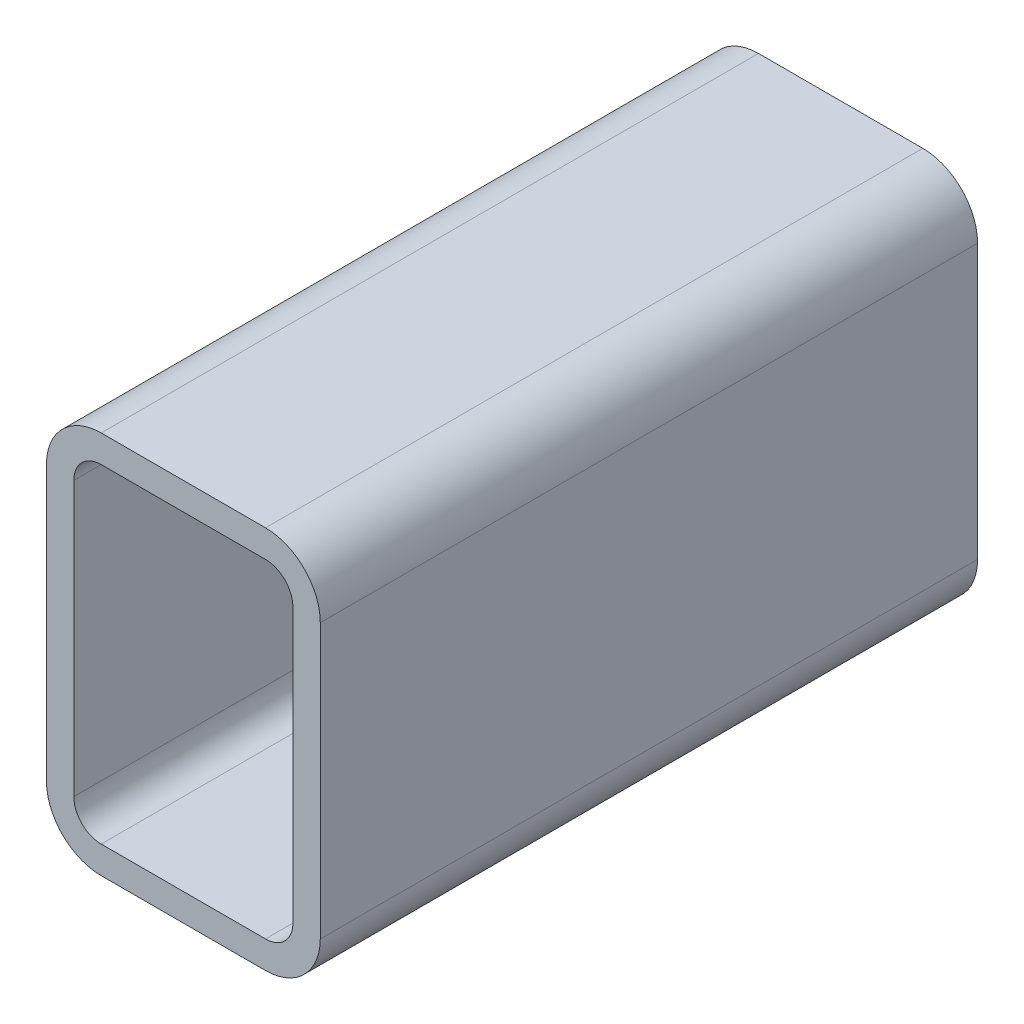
ISO-10303-21;
HEADER;
FILE_DESCRIPTION(('STEP AP214'),'2;1');
FILE_NAME('part.step','',(''),(''),'','','');
FILE_SCHEMA(('AUTOMOTIVE_DESIGN { 1 0 10303 214 1 1 1 1 }'));
ENDSEC;
DATA;
#1=APPLICATION_CONTEXT('core data for automotive mechanical design processes');
#2=APPLICATION_PROTOCOL_DEFINITION('international standard','automotive_design',2000,#1);
#3=PRODUCT_CONTEXT('',#1,'mechanical');
#4=PRODUCT('Part','Part','',(#3));
#5=PRODUCT_RELATED_PRODUCT_CATEGORY('part','',(#4));
#6=PRODUCT_DEFINITION_FORMATION('','',#4);
#7=PRODUCT_DEFINITION_CONTEXT('part definition',#1,'design');
#8=PRODUCT_DEFINITION('design','',#6,#7);
#9=PRODUCT_DEFINITION_SHAPE('','',#8);
#10=(LENGTH_UNIT() NAMED_UNIT(*) SI_UNIT(.MILLI.,.METRE.));
#11=(NAMED_UNIT(*) PLANE_ANGLE_UNIT() SI_UNIT($,.RADIAN.));
#12=(NAMED_UNIT(*) SI_UNIT($,.STERADIAN.) SOLID_ANGLE_UNIT());
#13=UNCERTAINTY_MEASURE_WITH_UNIT(LENGTH_MEASURE(1.E-05),#10,'distance_accuracy_value','');
#14=(GEOMETRIC_REPRESENTATION_CONTEXT(3) GLOBAL_UNCERTAINTY_ASSIGNED_CONTEXT((#13)) GLOBAL_UNIT_ASSIGNED_CONTEXT((#10,
#11,#12)) REPRESENTATION_CONTEXT('',''));
#15=CARTESIAN_POINT('',(0.,0.,0.));
#16=DIRECTION('',(0.,0.,1.));
#17=DIRECTION('',(1.,0.,0.));
#18=AXIS2_PLACEMENT_3D('',#15,#16,#17);
#19=CARTESIAN_POINT('',(26.2612396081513,154.389039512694,304.8));
#20=DIRECTION('',(0.,0.,1.));
#21=DIRECTION('',(1.,0.,0.));
#22=AXIS2_PLACEMENT_3D('',#19,#20,#21);
#23=PLANE('',#22);
#24=CARTESIAN_POINT('',(26.2612396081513,154.389039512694,304.8));
#25=DIRECTION('',(0.,0.,1.));
#26=DIRECTION('',(1.,0.,0.));
#27=AXIS2_PLACEMENT_3D('',#24,#25,#26);
#28=CIRCLE('',#27,25.4);
#29=CARTESIAN_POINT('',(26.2612396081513,179.789039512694,304.8));
#30=VERTEX_POINT('',#29);
#31=CARTESIAN_POINT('',(0.8612396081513,154.389039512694,304.8));
#32=VERTEX_POINT('',#31);
#33=EDGE_CURVE('E211',#30,#32,#28,.T.);
#34=ORIENTED_EDGE('',*,*,#33,.T.);
#35=DIRECTION('',(0.,-1.,0.));
#36=VECTOR('',#35,1.);
#37=CARTESIAN_POINT('',(0.8612396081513,27.3890395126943,304.8));
#38=LINE('',#37,#36);
#39=CARTESIAN_POINT('',(0.861239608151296,27.3890395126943,304.8));
#40=VERTEX_POINT('',#39);
#41=EDGE_CURVE('E214',#32,#40,#38,.T.);
#42=ORIENTED_EDGE('',*,*,#41,.T.);
#43=CARTESIAN_POINT('',(26.2612396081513,27.3890395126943,304.8));
#44=DIRECTION('',(0.,0.,1.));
#45=DIRECTION('',(1.,0.,0.));
#46=AXIS2_PLACEMENT_3D('',#43,#44,#45);
#47=CIRCLE('',#46,25.4);
#48=CARTESIAN_POINT('',(26.2612396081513,1.98903951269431,304.8));
#49=VERTEX_POINT('',#48);
#50=EDGE_CURVE('E217',#40,#49,#47,.T.);
#51=ORIENTED_EDGE('',*,*,#50,.T.);
#52=DIRECTION('',(1.,0.,0.));
#53=VECTOR('',#52,1.);
#54=CARTESIAN_POINT('',(102.461239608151,1.98903951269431,304.8));
#55=LINE('',#54,#53);
#56=CARTESIAN_POINT('',(102.461239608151,1.98903951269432,304.8));
#57=VERTEX_POINT('',#56);
#58=EDGE_CURVE('E219',#49,#57,#55,.T.);
#59=ORIENTED_EDGE('',*,*,#58,.T.);
#60=CARTESIAN_POINT('',(102.461239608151,27.3890395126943,304.8));
#61=DIRECTION('',(0.,0.,1.));
#62=DIRECTION('',(1.,0.,0.));
#63=AXIS2_PLACEMENT_3D('',#60,#61,#62);
#64=CIRCLE('',#63,25.4);
#65=CARTESIAN_POINT('',(127.861239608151,27.3890395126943,304.8));
#66=VERTEX_POINT('',#65);
#67=EDGE_CURVE('E221',#57,#66,#64,.T.);
#68=ORIENTED_EDGE('',*,*,#67,.T.);
#69=DIRECTION('',(0.,1.,0.));
#70=VECTOR('',#69,1.);
#71=CARTESIAN_POINT('',(127.861239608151,154.389039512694,304.8));
#72=LINE('',#71,#70);
#73=CARTESIAN_POINT('',(127.861239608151,154.389039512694,304.8));
#74=VERTEX_POINT('',#73);
#75=EDGE_CURVE('E223',#66,#74,#72,.T.);
#76=ORIENTED_EDGE('',*,*,#75,.T.);
#77=CARTESIAN_POINT('',(102.461239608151,154.389039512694,304.8));
#78=DIRECTION('',(0.,0.,1.));
#79=DIRECTION('',(1.,0.,0.));
#80=AXIS2_PLACEMENT_3D('',#77,#78,#79);
#81=CIRCLE('',#80,25.4);
#82=CARTESIAN_POINT('',(102.461239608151,179.789039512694,304.8));
#83=VERTEX_POINT('',#82);
#84=EDGE_CURVE('E225',#74,#83,#81,.T.);
#85=ORIENTED_EDGE('',*,*,#84,.T.);
#86=DIRECTION('',(-1.,0.,0.));
#87=VECTOR('',#86,1.);
#88=CARTESIAN_POINT('',(26.2612396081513,179.789039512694,304.8));
#89=LINE('',#88,#87);
#90=EDGE_CURVE('E227',#83,#30,#89,.T.);
#91=ORIENTED_EDGE('',*,*,#90,.T.);
#92=EDGE_LOOP('',(#34,#42,#51,#59,#68,#76,#85,#91));
#93=FACE_BOUND('',#92,.T.);
#94=DIRECTION('',(0.,-1.,0.));
#95=VECTOR('',#94,1.);
#96=CARTESIAN_POINT('',(13.5612396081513,27.3890395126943,304.8));
#97=LINE('',#96,#95);
#98=CARTESIAN_POINT('',(13.5612396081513,154.389039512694,304.8));
#99=VERTEX_POINT('',#98);
#100=CARTESIAN_POINT('',(13.5612396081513,27.3890395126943,304.8));
#101=VERTEX_POINT('',#100);
#102=EDGE_CURVE('E154',#99,#101,#97,.T.);
#103=ORIENTED_EDGE('',*,*,#102,.F.);
#104=CARTESIAN_POINT('',(26.2612396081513,154.389039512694,304.8));
#105=DIRECTION('',(0.,0.,1.));
#106=DIRECTION('',(1.,0.,0.));
#107=AXIS2_PLACEMENT_3D('',#104,#105,#106);
#108=CIRCLE('',#107,12.7);
#109=CARTESIAN_POINT('',(26.2612396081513,167.089039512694,304.8));
#110=VERTEX_POINT('',#109);
#111=EDGE_CURVE('E146',#110,#99,#108,.T.);
#112=ORIENTED_EDGE('',*,*,#111,.F.);
#113=DIRECTION('',(-1.,0.,0.));
#114=VECTOR('',#113,1.);
#115=CARTESIAN_POINT('',(26.2612396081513,167.089039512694,304.8));
#116=LINE('',#115,#114);
#117=CARTESIAN_POINT('',(102.461239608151,167.089039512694,304.8));
#118=VERTEX_POINT('',#117);
#119=EDGE_CURVE('E179',#118,#110,#116,.T.);
#120=ORIENTED_EDGE('',*,*,#119,.F.);
#121=CARTESIAN_POINT('',(102.461239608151,154.389039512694,304.8));
#122=DIRECTION('',(0.,0.,1.));
#123=DIRECTION('',(1.,0.,0.));
#124=AXIS2_PLACEMENT_3D('',#121,#122,#123);
#125=CIRCLE('',#124,12.7);
#126=CARTESIAN_POINT('',(115.161239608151,154.389039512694,304.8));
#127=VERTEX_POINT('',#126);
#128=EDGE_CURVE('E177',#127,#118,#125,.T.);
#129=ORIENTED_EDGE('',*,*,#128,.F.);
#130=DIRECTION('',(0.,1.,0.));
#131=VECTOR('',#130,1.);
#132=CARTESIAN_POINT('',(115.161239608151,154.389039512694,304.8));
#133=LINE('',#132,#131);
#134=CARTESIAN_POINT('',(115.161239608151,27.3890395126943,304.8));
#135=VERTEX_POINT('',#134);
#136=EDGE_CURVE('E175',#135,#127,#133,.T.);
#137=ORIENTED_EDGE('',*,*,#136,.F.);
#138=CARTESIAN_POINT('',(102.461239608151,27.3890395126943,304.8));
#139=DIRECTION('',(0.,0.,1.));
#140=DIRECTION('',(1.,0.,0.));
#141=AXIS2_PLACEMENT_3D('',#138,#139,#140);
#142=CIRCLE('',#141,12.7);
#143=CARTESIAN_POINT('',(102.461239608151,14.6890395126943,304.8));
#144=VERTEX_POINT('',#143);
#145=EDGE_CURVE('E173',#144,#135,#142,.T.);
#146=ORIENTED_EDGE('',*,*,#145,.F.);
#147=DIRECTION('',(1.,0.,0.));
#148=VECTOR('',#147,1.);
#149=CARTESIAN_POINT('',(102.461239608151,14.6890395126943,304.8));
#150=LINE('',#149,#148);
#151=CARTESIAN_POINT('',(26.2612396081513,14.6890395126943,304.8));
#152=VERTEX_POINT('',#151);
#153=EDGE_CURVE('E169',#152,#144,#150,.T.);
#154=ORIENTED_EDGE('',*,*,#153,.F.);
#155=CARTESIAN_POINT('',(26.2612396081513,27.3890395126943,304.8));
#156=DIRECTION('',(0.,0.,1.));
#157=DIRECTION('',(1.,0.,0.));
#158=AXIS2_PLACEMENT_3D('',#155,#156,#157);
#159=CIRCLE('',#158,12.7);
#160=EDGE_CURVE('E167',#101,#152,#159,.T.);
#161=ORIENTED_EDGE('',*,*,#160,.F.);
#162=EDGE_LOOP('',(#103,#112,#120,#129,#137,#146,#154,#161));
#163=FACE_BOUND('',#162,.T.);
#164=ADVANCED_FACE('F33',(#93,#163),#23,.T.);
#165=CARTESIAN_POINT('',(26.2612396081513,154.389039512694,0.));
#166=DIRECTION('',(0.,0.,1.));
#167=DIRECTION('',(1.,0.,0.));
#168=AXIS2_PLACEMENT_3D('',#165,#166,#167);
#169=PLANE('',#168);
#170=CARTESIAN_POINT('',(26.2612396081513,154.389039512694,0.));
#171=DIRECTION('',(0.,0.,1.));
#172=DIRECTION('',(1.,0.,0.));
#173=AXIS2_PLACEMENT_3D('',#170,#171,#172);
#174=CIRCLE('',#173,25.4);
#175=CARTESIAN_POINT('',(26.2612396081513,179.789039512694,0.));
#176=VERTEX_POINT('',#175);
#177=CARTESIAN_POINT('',(0.8612396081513,154.389039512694,0.));
#178=VERTEX_POINT('',#177);
#179=EDGE_CURVE('E162',#176,#178,#174,.T.);
#180=ORIENTED_EDGE('',*,*,#179,.F.);
#181=DIRECTION('',(-1.,0.,0.));
#182=VECTOR('',#181,1.);
#183=CARTESIAN_POINT('',(26.2612396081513,179.789039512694,0.));
#184=LINE('',#183,#182);
#185=CARTESIAN_POINT('',(102.461239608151,179.789039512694,0.));
#186=VERTEX_POINT('',#185);
#187=EDGE_CURVE('E215',#186,#176,#184,.T.);
#188=ORIENTED_EDGE('',*,*,#187,.F.);
#189=CARTESIAN_POINT('',(102.461239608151,154.389039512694,0.));
#190=DIRECTION('',(0.,0.,1.));
#191=DIRECTION('',(1.,0.,0.));
#192=AXIS2_PLACEMENT_3D('',#189,#190,#191);
#193=CIRCLE('',#192,25.4);
#194=CARTESIAN_POINT('',(127.861239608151,154.389039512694,0.));
#195=VERTEX_POINT('',#194);
#196=EDGE_CURVE('E242',#195,#186,#193,.T.);
#197=ORIENTED_EDGE('',*,*,#196,.F.);
#198=DIRECTION('',(0.,1.,0.));
#199=VECTOR('',#198,1.);
#200=CARTESIAN_POINT('',(127.861239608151,154.389039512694,0.));
#201=LINE('',#200,#199);
#202=CARTESIAN_POINT('',(127.861239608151,27.3890395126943,0.));
#203=VERTEX_POINT('',#202);
#204=EDGE_CURVE('E240',#203,#195,#201,.T.);
#205=ORIENTED_EDGE('',*,*,#204,.F.);
#206=CARTESIAN_POINT('',(102.461239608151,27.3890395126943,0.));
#207=DIRECTION('',(0.,0.,1.));
#208=DIRECTION('',(1.,0.,0.));
#209=AXIS2_PLACEMENT_3D('',#206,#207,#208);
#210=CIRCLE('',#209,25.4);
#211=CARTESIAN_POINT('',(102.461239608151,1.98903951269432,0.));
#212=VERTEX_POINT('',#211);
#213=EDGE_CURVE('E238',#212,#203,#210,.T.);
#214=ORIENTED_EDGE('',*,*,#213,.F.);
#215=DIRECTION('',(1.,0.,0.));
#216=VECTOR('',#215,1.);
#217=CARTESIAN_POINT('',(102.461239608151,1.98903951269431,0.));
#218=LINE('',#217,#216);
#219=CARTESIAN_POINT('',(26.2612396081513,1.98903951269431,0.));
#220=VERTEX_POINT('',#219);
#221=EDGE_CURVE('E236',#220,#212,#218,.T.);
#222=ORIENTED_EDGE('',*,*,#221,.F.);
#223=CARTESIAN_POINT('',(26.2612396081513,27.3890395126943,0.));
#224=DIRECTION('',(0.,0.,1.));
#225=DIRECTION('',(1.,0.,0.));
#226=AXIS2_PLACEMENT_3D('',#223,#224,#225);
#227=CIRCLE('',#226,25.4);
#228=CARTESIAN_POINT('',(0.861239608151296,27.3890395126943,0.));
#229=VERTEX_POINT('',#228);
#230=EDGE_CURVE('E234',#229,#220,#227,.T.);
#231=ORIENTED_EDGE('',*,*,#230,.F.);
#232=DIRECTION('',(0.,-1.,0.));
#233=VECTOR('',#232,1.);
#234=CARTESIAN_POINT('',(0.8612396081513,27.3890395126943,0.));
#235=LINE('',#234,#233);
#236=EDGE_CURVE('E232',#178,#229,#235,.T.);
#237=ORIENTED_EDGE('',*,*,#236,.F.);
#238=EDGE_LOOP('',(#180,#188,#197,#205,#214,#222,#231,#237));
#239=FACE_BOUND('',#238,.T.);
#240=CARTESIAN_POINT('',(26.2612396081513,154.389039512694,0.));
#241=DIRECTION('',(0.,0.,1.));
#242=DIRECTION('',(1.,0.,0.));
#243=AXIS2_PLACEMENT_3D('',#240,#241,#242);
#244=CIRCLE('',#243,12.7);
#245=CARTESIAN_POINT('',(26.2612396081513,167.089039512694,0.));
#246=VERTEX_POINT('',#245);
#247=CARTESIAN_POINT('',(13.5612396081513,154.389039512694,0.));
#248=VERTEX_POINT('',#247);
#249=EDGE_CURVE('E56',#246,#248,#244,.T.);
#250=ORIENTED_EDGE('',*,*,#249,.T.);
#251=DIRECTION('',(0.,-1.,0.));
#252=VECTOR('',#251,1.);
#253=CARTESIAN_POINT('',(13.5612396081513,27.3890395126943,0.));
#254=LINE('',#253,#252);
#255=CARTESIAN_POINT('',(13.5612396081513,27.3890395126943,0.));
#256=VERTEX_POINT('',#255);
#257=EDGE_CURVE('E161',#248,#256,#254,.T.);
#258=ORIENTED_EDGE('',*,*,#257,.T.);
#259=CARTESIAN_POINT('',(26.2612396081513,27.3890395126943,0.));
#260=DIRECTION('',(0.,0.,1.));
#261=DIRECTION('',(1.,0.,0.));
#262=AXIS2_PLACEMENT_3D('',#259,#260,#261);
#263=CIRCLE('',#262,12.7);
#264=CARTESIAN_POINT('',(26.2612396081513,14.6890395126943,0.));
#265=VERTEX_POINT('',#264);
#266=EDGE_CURVE('E183',#256,#265,#263,.T.);
#267=ORIENTED_EDGE('',*,*,#266,.T.);
#268=DIRECTION('',(1.,0.,0.));
#269=VECTOR('',#268,1.);
#270=CARTESIAN_POINT('',(102.461239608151,14.6890395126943,0.));
#271=LINE('',#270,#269);
#272=CARTESIAN_POINT('',(102.461239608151,14.6890395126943,0.));
#273=VERTEX_POINT('',#272);
#274=EDGE_CURVE('E186',#265,#273,#271,.T.);
#275=ORIENTED_EDGE('',*,*,#274,.T.);
#276=CARTESIAN_POINT('',(102.461239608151,27.3890395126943,0.));
#277=DIRECTION('',(0.,0.,1.));
#278=DIRECTION('',(1.,0.,0.));
#279=AXIS2_PLACEMENT_3D('',#276,#277,#278);
#280=CIRCLE('',#279,12.7);
#281=CARTESIAN_POINT('',(115.161239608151,27.3890395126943,0.));
#282=VERTEX_POINT('',#281);
#283=EDGE_CURVE('E189',#273,#282,#280,.T.);
#284=ORIENTED_EDGE('',*,*,#283,.T.);
#285=DIRECTION('',(0.,1.,0.));
#286=VECTOR('',#285,1.);
#287=CARTESIAN_POINT('',(115.161239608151,154.389039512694,0.));
#288=LINE('',#287,#286);
#289=CARTESIAN_POINT('',(115.161239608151,154.389039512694,0.));
#290=VERTEX_POINT('',#289);
#291=EDGE_CURVE('E192',#282,#290,#288,.T.);
#292=ORIENTED_EDGE('',*,*,#291,.T.);
#293=CARTESIAN_POINT('',(102.461239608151,154.389039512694,0.));
#294=DIRECTION('',(0.,0.,1.));
#295=DIRECTION('',(1.,0.,0.));
#296=AXIS2_PLACEMENT_3D('',#293,#294,#295);
#297=CIRCLE('',#296,12.7);
#298=CARTESIAN_POINT('',(102.461239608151,167.089039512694,0.));
#299=VERTEX_POINT('',#298);
#300=EDGE_CURVE('E195',#290,#299,#297,.T.);
#301=ORIENTED_EDGE('',*,*,#300,.T.);
#302=DIRECTION('',(-1.,0.,0.));
#303=VECTOR('',#302,1.);
#304=CARTESIAN_POINT('',(26.2612396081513,167.089039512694,0.));
#305=LINE('',#304,#303);
#306=EDGE_CURVE('E155',#299,#246,#305,.T.);
#307=ORIENTED_EDGE('',*,*,#306,.T.);
#308=EDGE_LOOP('',(#250,#258,#267,#275,#284,#292,#301,#307));
#309=FACE_BOUND('',#308,.T.);
#310=ADVANCED_FACE('F272',(#239,#309),#169,.F.);
#311=CARTESIAN_POINT('',(26.2612396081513,154.389039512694,304.8));
#312=DIRECTION('',(0.,0.,-1.));
#313=DIRECTION('',(-1.,0.,0.));
#314=AXIS2_PLACEMENT_3D('',#311,#312,#313);
#315=CYLINDRICAL_SURFACE('',#314,25.4);
#316=ORIENTED_EDGE('',*,*,#179,.T.);
#317=DIRECTION('',(0.,0.,-1.));
#318=VECTOR('',#317,1.);
#319=CARTESIAN_POINT('',(0.8612396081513,154.389039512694,304.8));
#320=LINE('',#319,#318);
#321=EDGE_CURVE('E11',#32,#178,#320,.T.);
#322=ORIENTED_EDGE('',*,*,#321,.F.);
#323=ORIENTED_EDGE('',*,*,#33,.F.);
#324=DIRECTION('',(0.,0.,-1.));
#325=VECTOR('',#324,1.);
#326=CARTESIAN_POINT('',(26.2612396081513,179.789039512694,304.8));
#327=LINE('',#326,#325);
#328=EDGE_CURVE('E229',#30,#176,#327,.T.);
#329=ORIENTED_EDGE('',*,*,#328,.T.);
#330=EDGE_LOOP('',(#316,#322,#323,#329));
#331=FACE_BOUND('',#330,.T.);
#332=ADVANCED_FACE('F35',(#331),#315,.T.);
#333=CARTESIAN_POINT('',(0.8612396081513,27.3890395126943,304.8));
#334=DIRECTION('',(1.,0.,0.));
#335=DIRECTION('',(0.,0.,-1.));
#336=AXIS2_PLACEMENT_3D('',#333,#334,#335);
#337=PLANE('',#336);
#338=ORIENTED_EDGE('',*,*,#236,.T.);
#339=DIRECTION('',(0.,0.,-1.));
#340=VECTOR('',#339,1.);
#341=CARTESIAN_POINT('',(0.861239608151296,27.3890395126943,304.8));
#342=LINE('',#341,#340);
#343=EDGE_CURVE('E41',#40,#229,#342,.T.);
#344=ORIENTED_EDGE('',*,*,#343,.F.);
#345=ORIENTED_EDGE('',*,*,#41,.F.);
#346=ORIENTED_EDGE('',*,*,#321,.T.);
#347=EDGE_LOOP('',(#338,#344,#345,#346));
#348=FACE_BOUND('',#347,.T.);
#349=ADVANCED_FACE('F289',(#348),#337,.F.);
#350=CARTESIAN_POINT('',(26.2612396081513,27.3890395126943,304.8));
#351=DIRECTION('',(0.,0.,-1.));
#352=DIRECTION('',(-1.,0.,0.));
#353=AXIS2_PLACEMENT_3D('',#350,#351,#352);
#354=CYLINDRICAL_SURFACE('',#353,25.4);
#355=ORIENTED_EDGE('',*,*,#230,.T.);
#356=DIRECTION('',(0.,0.,-1.));
#357=VECTOR('',#356,1.);
#358=CARTESIAN_POINT('',(26.2612396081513,1.98903951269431,304.8));
#359=LINE('',#358,#357);
#360=EDGE_CURVE('E259',#49,#220,#359,.T.);
#361=ORIENTED_EDGE('',*,*,#360,.F.);
#362=ORIENTED_EDGE('',*,*,#50,.F.);
#363=ORIENTED_EDGE('',*,*,#343,.T.);
#364=EDGE_LOOP('',(#355,#361,#362,#363));
#365=FACE_BOUND('',#364,.T.);
#366=ADVANCED_FACE('F266',(#365),#354,.T.);
#367=CARTESIAN_POINT('',(102.461239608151,1.98903951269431,304.8));
#368=DIRECTION('',(0.,1.,0.));
#369=DIRECTION('',(0.,0.,1.));
#370=AXIS2_PLACEMENT_3D('',#367,#368,#369);
#371=PLANE('',#370);
#372=ORIENTED_EDGE('',*,*,#221,.T.);
#373=DIRECTION('',(0.,0.,-1.));
#374=VECTOR('',#373,1.);
#375=CARTESIAN_POINT('',(102.461239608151,1.98903951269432,304.8));
#376=LINE('',#375,#374);
#377=EDGE_CURVE('E256',#57,#212,#376,.T.);
#378=ORIENTED_EDGE('',*,*,#377,.F.);
#379=ORIENTED_EDGE('',*,*,#58,.F.);
#380=ORIENTED_EDGE('',*,*,#360,.T.);
#381=EDGE_LOOP('',(#372,#378,#379,#380));
#382=FACE_BOUND('',#381,.T.);
#383=ADVANCED_FACE('F278',(#382),#371,.F.);
#384=CARTESIAN_POINT('',(102.461239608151,27.3890395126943,304.8));
#385=DIRECTION('',(0.,0.,-1.));
#386=DIRECTION('',(-1.,0.,0.));
#387=AXIS2_PLACEMENT_3D('',#384,#385,#386);
#388=CYLINDRICAL_SURFACE('',#387,25.4);
#389=ORIENTED_EDGE('',*,*,#213,.T.);
#390=DIRECTION('',(0.,0.,-1.));
#391=VECTOR('',#390,1.);
#392=CARTESIAN_POINT('',(127.861239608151,27.3890395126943,304.8));
#393=LINE('',#392,#391);
#394=EDGE_CURVE('E253',#66,#203,#393,.T.);
#395=ORIENTED_EDGE('',*,*,#394,.F.);
#396=ORIENTED_EDGE('',*,*,#67,.F.);
#397=ORIENTED_EDGE('',*,*,#377,.T.);
#398=EDGE_LOOP('',(#389,#395,#396,#397));
#399=FACE_BOUND('',#398,.T.);
#400=ADVANCED_FACE('F282',(#399),#388,.T.);
#401=CARTESIAN_POINT('',(127.861239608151,154.389039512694,304.8));
#402=DIRECTION('',(-1.,0.,0.));
#403=DIRECTION('',(0.,0.,1.));
#404=AXIS2_PLACEMENT_3D('',#401,#402,#403);
#405=PLANE('',#404);
#406=ORIENTED_EDGE('',*,*,#204,.T.);
#407=DIRECTION('',(0.,0.,-1.));
#408=VECTOR('',#407,1.);
#409=CARTESIAN_POINT('',(127.861239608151,154.389039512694,304.8));
#410=LINE('',#409,#408);
#411=EDGE_CURVE('E250',#74,#195,#410,.T.);
#412=ORIENTED_EDGE('',*,*,#411,.F.);
#413=ORIENTED_EDGE('',*,*,#75,.F.);
#414=ORIENTED_EDGE('',*,*,#394,.T.);
#415=EDGE_LOOP('',(#406,#412,#413,#414));
#416=FACE_BOUND('',#415,.T.);
#417=ADVANCED_FACE('F302',(#416),#405,.F.);
#418=CARTESIAN_POINT('',(102.461239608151,154.389039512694,304.8));
#419=DIRECTION('',(0.,0.,-1.));
#420=DIRECTION('',(-1.,0.,0.));
#421=AXIS2_PLACEMENT_3D('',#418,#419,#420);
#422=CYLINDRICAL_SURFACE('',#421,25.4);
#423=ORIENTED_EDGE('',*,*,#196,.T.);
#424=DIRECTION('',(0.,0.,-1.));
#425=VECTOR('',#424,1.);
#426=CARTESIAN_POINT('',(102.461239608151,179.789039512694,304.8));
#427=LINE('',#426,#425);
#428=EDGE_CURVE('E247',#83,#186,#427,.T.);
#429=ORIENTED_EDGE('',*,*,#428,.F.);
#430=ORIENTED_EDGE('',*,*,#84,.F.);
#431=ORIENTED_EDGE('',*,*,#411,.T.);
#432=EDGE_LOOP('',(#423,#429,#430,#431));
#433=FACE_BOUND('',#432,.T.);
#434=ADVANCED_FACE('F300',(#433),#422,.T.);
#435=CARTESIAN_POINT('',(26.2612396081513,179.789039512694,304.8));
#436=DIRECTION('',(0.,-1.,0.));
#437=DIRECTION('',(0.,0.,-1.));
#438=AXIS2_PLACEMENT_3D('',#435,#436,#437);
#439=PLANE('',#438);
#440=ORIENTED_EDGE('',*,*,#187,.T.);
#441=ORIENTED_EDGE('',*,*,#328,.F.);
#442=ORIENTED_EDGE('',*,*,#90,.F.);
#443=ORIENTED_EDGE('',*,*,#428,.T.);
#444=EDGE_LOOP('',(#440,#441,#442,#443));
#445=FACE_BOUND('',#444,.T.);
#446=ADVANCED_FACE('F295',(#445),#439,.F.);
#447=CARTESIAN_POINT('',(26.2612396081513,154.389039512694,304.8));
#448=DIRECTION('',(0.,0.,-1.));
#449=DIRECTION('',(-1.,0.,0.));
#450=AXIS2_PLACEMENT_3D('',#447,#448,#449);
#451=CYLINDRICAL_SURFACE('',#450,12.7);
#452=ORIENTED_EDGE('',*,*,#249,.F.);
#453=DIRECTION('',(0.,0.,-1.));
#454=VECTOR('',#453,1.);
#455=CARTESIAN_POINT('',(26.2612396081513,167.089039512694,304.8));
#456=LINE('',#455,#454);
#457=EDGE_CURVE('E150',#110,#246,#456,.T.);
#458=ORIENTED_EDGE('',*,*,#457,.F.);
#459=ORIENTED_EDGE('',*,*,#111,.T.);
#460=DIRECTION('',(0.,0.,-1.));
#461=VECTOR('',#460,1.);
#462=CARTESIAN_POINT('',(13.5612396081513,154.389039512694,304.8));
#463=LINE('',#462,#461);
#464=EDGE_CURVE('E149',#99,#248,#463,.T.);
#465=ORIENTED_EDGE('',*,*,#464,.T.);
#466=EDGE_LOOP('',(#452,#458,#459,#465));
#467=FACE_BOUND('',#466,.T.);
#468=ADVANCED_FACE('F148',(#467),#451,.F.);
#469=CARTESIAN_POINT('',(13.5612396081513,27.3890395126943,304.8));
#470=DIRECTION('',(1.,0.,0.));
#471=DIRECTION('',(0.,0.,-1.));
#472=AXIS2_PLACEMENT_3D('',#469,#470,#471);
#473=PLANE('',#472);
#474=ORIENTED_EDGE('',*,*,#257,.F.);
#475=ORIENTED_EDGE('',*,*,#464,.F.);
#476=ORIENTED_EDGE('',*,*,#102,.T.);
#477=DIRECTION('',(0.,0.,-1.));
#478=VECTOR('',#477,1.);
#479=CARTESIAN_POINT('',(13.5612396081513,27.3890395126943,304.8));
#480=LINE('',#479,#478);
#481=EDGE_CURVE('E163',#101,#256,#480,.T.);
#482=ORIENTED_EDGE('',*,*,#481,.T.);
#483=EDGE_LOOP('',(#474,#475,#476,#482));
#484=FACE_BOUND('',#483,.T.);
#485=ADVANCED_FACE('F158',(#484),#473,.T.);
#486=CARTESIAN_POINT('',(26.2612396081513,27.3890395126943,304.8));
#487=DIRECTION('',(0.,0.,-1.));
#488=DIRECTION('',(-1.,0.,0.));
#489=AXIS2_PLACEMENT_3D('',#486,#487,#488);
#490=CYLINDRICAL_SURFACE('',#489,12.7);
#491=ORIENTED_EDGE('',*,*,#266,.F.);
#492=ORIENTED_EDGE('',*,*,#481,.F.);
#493=ORIENTED_EDGE('',*,*,#160,.T.);
#494=DIRECTION('',(0.,0.,-1.));
#495=VECTOR('',#494,1.);
#496=CARTESIAN_POINT('',(26.2612396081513,14.6890395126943,304.8));
#497=LINE('',#496,#495);
#498=EDGE_CURVE('E208',#152,#265,#497,.T.);
#499=ORIENTED_EDGE('',*,*,#498,.T.);
#500=EDGE_LOOP('',(#491,#492,#493,#499));
#501=FACE_BOUND('',#500,.T.);
#502=ADVANCED_FACE('F327',(#501),#490,.F.);
#503=CARTESIAN_POINT('',(102.461239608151,14.6890395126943,304.8));
#504=DIRECTION('',(0.,1.,0.));
#505=DIRECTION('',(0.,0.,1.));
#506=AXIS2_PLACEMENT_3D('',#503,#504,#505);
#507=PLANE('',#506);
#508=ORIENTED_EDGE('',*,*,#274,.F.);
#509=ORIENTED_EDGE('',*,*,#498,.F.);
#510=ORIENTED_EDGE('',*,*,#153,.T.);
#511=DIRECTION('',(0.,0.,-1.));
#512=VECTOR('',#511,1.);
#513=CARTESIAN_POINT('',(102.461239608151,14.6890395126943,304.8));
#514=LINE('',#513,#512);
#515=EDGE_CURVE('E206',#144,#273,#514,.T.);
#516=ORIENTED_EDGE('',*,*,#515,.T.);
#517=EDGE_LOOP('',(#508,#509,#510,#516));
#518=FACE_BOUND('',#517,.T.);
#519=ADVANCED_FACE('F331',(#518),#507,.T.);
#520=CARTESIAN_POINT('',(102.461239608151,27.3890395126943,304.8));
#521=DIRECTION('',(0.,0.,-1.));
#522=DIRECTION('',(-1.,0.,0.));
#523=AXIS2_PLACEMENT_3D('',#520,#521,#522);
#524=CYLINDRICAL_SURFACE('',#523,12.7);
#525=ORIENTED_EDGE('',*,*,#283,.F.);
#526=ORIENTED_EDGE('',*,*,#515,.F.);
#527=ORIENTED_EDGE('',*,*,#145,.T.);
#528=DIRECTION('',(0.,0.,-1.));
#529=VECTOR('',#528,1.);
#530=CARTESIAN_POINT('',(115.161239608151,27.3890395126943,304.8));
#531=LINE('',#530,#529);
#532=EDGE_CURVE('E204',#135,#282,#531,.T.);
#533=ORIENTED_EDGE('',*,*,#532,.T.);
#534=EDGE_LOOP('',(#525,#526,#527,#533));
#535=FACE_BOUND('',#534,.T.);
#536=ADVANCED_FACE('F337',(#535),#524,.F.);
#537=CARTESIAN_POINT('',(115.161239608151,154.389039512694,304.8));
#538=DIRECTION('',(-1.,0.,0.));
#539=DIRECTION('',(0.,0.,1.));
#540=AXIS2_PLACEMENT_3D('',#537,#538,#539);
#541=PLANE('',#540);
#542=ORIENTED_EDGE('',*,*,#291,.F.);
#543=ORIENTED_EDGE('',*,*,#532,.F.);
#544=ORIENTED_EDGE('',*,*,#136,.T.);
#545=DIRECTION('',(0.,0.,-1.));
#546=VECTOR('',#545,1.);
#547=CARTESIAN_POINT('',(115.161239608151,154.389039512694,304.8));
#548=LINE('',#547,#546);
#549=EDGE_CURVE('E202',#127,#290,#548,.T.);
#550=ORIENTED_EDGE('',*,*,#549,.T.);
#551=EDGE_LOOP('',(#542,#543,#544,#550));
#552=FACE_BOUND('',#551,.T.);
#553=ADVANCED_FACE('F341',(#552),#541,.T.);
#554=CARTESIAN_POINT('',(102.461239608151,154.389039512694,304.8));
#555=DIRECTION('',(0.,0.,-1.));
#556=DIRECTION('',(-1.,0.,0.));
#557=AXIS2_PLACEMENT_3D('',#554,#555,#556);
#558=CYLINDRICAL_SURFACE('',#557,12.7);
#559=ORIENTED_EDGE('',*,*,#300,.F.);
#560=ORIENTED_EDGE('',*,*,#549,.F.);
#561=ORIENTED_EDGE('',*,*,#128,.T.);
#562=DIRECTION('',(0.,0.,-1.));
#563=VECTOR('',#562,1.);
#564=CARTESIAN_POINT('',(102.461239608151,167.089039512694,304.8));
#565=LINE('',#564,#563);
#566=EDGE_CURVE('E48',#118,#299,#565,.T.);
#567=ORIENTED_EDGE('',*,*,#566,.T.);
#568=EDGE_LOOP('',(#559,#560,#561,#567));
#569=FACE_BOUND('',#568,.T.);
#570=ADVANCED_FACE('F345',(#569),#558,.F.);
#571=CARTESIAN_POINT('',(26.2612396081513,167.089039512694,304.8));
#572=DIRECTION('',(0.,-1.,0.));
#573=DIRECTION('',(0.,0.,-1.));
#574=AXIS2_PLACEMENT_3D('',#571,#572,#573);
#575=PLANE('',#574);
#576=ORIENTED_EDGE('',*,*,#306,.F.);
#577=ORIENTED_EDGE('',*,*,#566,.F.);
#578=ORIENTED_EDGE('',*,*,#119,.T.);
#579=ORIENTED_EDGE('',*,*,#457,.T.);
#580=EDGE_LOOP('',(#576,#577,#578,#579));
#581=FACE_BOUND('',#580,.T.);
#582=ADVANCED_FACE('F349',(#581),#575,.T.);
#583=CLOSED_SHELL('',(#164,#310,#332,#349,#366,#383,#400,#417,#434,#446,#468,#485,#502,#519,
#536,#553,#570,#582));
#584=MANIFOLD_SOLID_BREP('B2',#583);
#585=ADVANCED_BREP_SHAPE_REPRESENTATION('',(#18,#584),#14);
#586=SHAPE_DEFINITION_REPRESENTATION(#9,#585);
ENDSEC;
END-ISO-10303-21;
